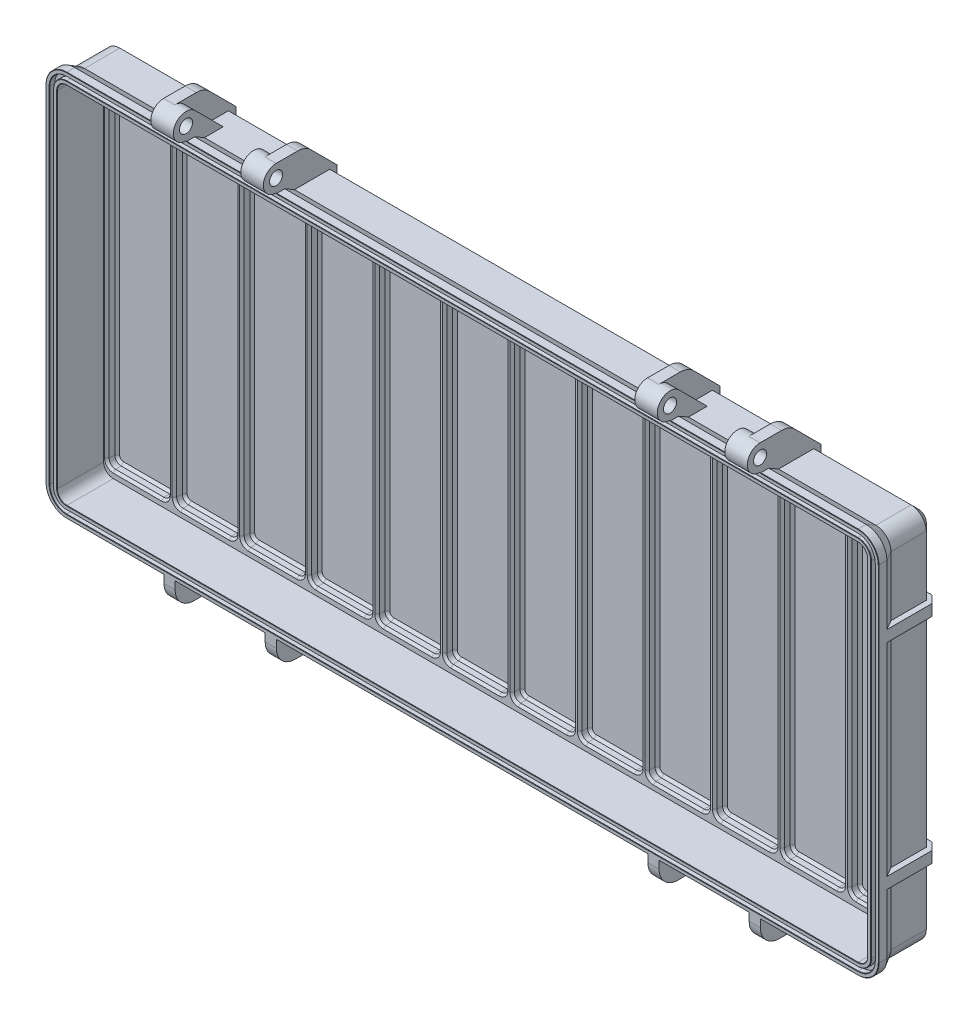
from build123d import *

# Parameters (mm, degrees)
BOSS_EXTRUDE1_DEPTH     = 1
BOSS_EXTRUDE1_DRAFT     = -45
BOSS_EXTRUDE2_DEPTH     = 13
BOSS_EXTRUDE3_DEPTH     = 5
BOSS_EXTRUDE3_DRAFT     = -30
BOSS_EXTRUDE4_DEPTH     = 2.2
SKETCH18_W              = 309.428038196
SKETCH18_H              = 147.831757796
CUT_EXTRUDE7_DEPTH      = 5
CUT_EXTRUDE7_DRAFT      = -45
CUT_EXTRUDE1_DEPTH      = 12.45
CUT_EXTRUDE2_DEPTH      = 0.6
CUT_EXTRUDE2_DRAFT      = -45
CUT_EXTRUDE3_DEPTH      = 1.5
CUT_EXTRUDE4_DEPTH      = 0.65
CUT_EXTRUDE4_DRAFT      = -45
LPATTERN1_COUNT         = 12
LPATTERN1_PITCH         = 18
LPATTERN1_COPY_1_DEPTH  = 0.6
LPATTERN1_COPY_1_DRAFT  = -45
LPATTERN1_COPY_2_DEPTH  = 0.6
LPATTERN1_COPY_2_DRAFT  = -45
LPATTERN1_COPY_3_DEPTH  = 0.6
LPATTERN1_COPY_3_DRAFT  = -45
LPATTERN1_COPY_4_DEPTH  = 0.6
LPATTERN1_COPY_4_DRAFT  = -45
LPATTERN1_COPY_5_DEPTH  = 0.6
LPATTERN1_COPY_5_DRAFT  = -45
LPATTERN1_COPY_6_DEPTH  = 0.6
LPATTERN1_COPY_6_DRAFT  = -45
LPATTERN1_COPY_7_DEPTH  = 0.6
LPATTERN1_COPY_7_DRAFT  = -45
LPATTERN1_COPY_8_DEPTH  = 0.6
LPATTERN1_COPY_8_DRAFT  = -45
LPATTERN1_COPY_9_DEPTH  = 0.6
LPATTERN1_COPY_9_DRAFT  = -45
LPATTERN1_COPY_10_DEPTH = 0.6
LPATTERN1_COPY_10_DRAFT = -45
LPATTERN1_COPY_11_DEPTH = 0.6
LPATTERN1_COPY_11_DRAFT = -45
LPATTERN1_COPY_12_DEPTH = 0.65
LPATTERN1_COPY_12_DRAFT = -45
LPATTERN1_COPY_13_DEPTH = 0.65
LPATTERN1_COPY_13_DRAFT = -45
LPATTERN1_COPY_14_DEPTH = 0.65
LPATTERN1_COPY_14_DRAFT = -45
LPATTERN1_COPY_15_DEPTH = 0.65
LPATTERN1_COPY_15_DRAFT = -45
LPATTERN1_COPY_16_DEPTH = 0.65
LPATTERN1_COPY_16_DRAFT = -45
LPATTERN1_COPY_17_DEPTH = 0.65
LPATTERN1_COPY_17_DRAFT = -45
LPATTERN1_COPY_18_DEPTH = 0.65
LPATTERN1_COPY_18_DRAFT = -45
LPATTERN1_COPY_19_DEPTH = 0.65
LPATTERN1_COPY_19_DRAFT = -45
LPATTERN1_COPY_20_DEPTH = 0.65
LPATTERN1_COPY_20_DRAFT = -45
LPATTERN1_COPY_21_DEPTH = 0.65
LPATTERN1_COPY_21_DRAFT = -45
LPATTERN1_COPY_22_DEPTH = 0.65
LPATTERN1_COPY_22_DRAFT = -45
CUT_EXTRUDE5_DEPTH      = 1.4
BOSS_EXTRUDE5_DEPTH     = 3
MIRROR2_COPY_1_DEPTH    = 3
CHAMFER1_SIZE           = 0.1
CHAMFER2_SIZE           = 0.1
SKETCH12_R              = 1.75
BOSS_EXTRUDE6_DEPTH     = 3
SKETCH13_R              = 1.75
BOSS_EXTRUDE7_DEPTH     = 3
MIRROR4_COPY_1_SKETCH_R = 1.75
MIRROR4_COPY_1_DEPTH    = 3
MIRROR4_COPY_2_SKETCH_R = 1.75
MIRROR4_COPY_2_DEPTH    = 3
SKETCH14_R              = 1.75
BOSS_EXTRUDE8_DEPTH     = 3
LPATTERN2_COUNT         = 2
LPATTERN2_PITCH         = 27
MIRROR5_COPY_1_SKETCH_R = 1.75
MIRROR5_COPY_1_DEPTH    = 3


with BuildPart() as part:
    # Sketch1 → Boss-Extrude1 (with draft: the straight prism first)
    with BuildSketch(Plane.XY):
        with BuildLine():
            ThreePointArc((-105.45, 50), (-108.313782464, 48.813782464), (-109.5, 45.95))
            Line((-109.5, 45.95), (-109.5, -45.95))
            ThreePointArc((-109.5, -45.95), (-108.313782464, -48.813782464), (-105.45, -50))
            Line((-105.45, -50), (105.45, -50))
            ThreePointArc((105.45, -50), (108.313782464, -48.813782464), (109.5, -45.95))
            Line((109.5, -45.95), (109.5, 45.95))
            ThreePointArc((109.5, 45.95), (108.313782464, 48.813782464), (105.45, 50))
            Line((105.45, 50), (-105.45, 50))
        make_face()
    extrude(amount=-BOSS_EXTRUDE1_DEPTH)
    # Boss-Extrude1: the draft: its side faces are tilted about the plane it starts from
    boss_extrude1_sides = [part.faces().sort_by_distance(p)[0] for p in [
        (-108.313782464, 48.813782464, -0.5),
        (-109.5, 0, -0.5),
        (-108.313782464, -48.813782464, -0.5),
        (0, -50, -0.5),
        (108.313782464, -48.813782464, -0.5),
        (109.5, 0, -0.5),
        (108.313782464, 48.813782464, -0.5),
        (0, 50, -0.5),
    ]]
    draft(boss_extrude1_sides, Plane.XY, BOSS_EXTRUDE1_DRAFT)

    # Sketch2 → Boss-Extrude2 (add)
    with BuildSketch(Plane.XY):
        with BuildLine():
            Line((-105.45, -50), (105.45, -50))
            ThreePointArc((105.45, -50), (108.313782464, -48.813782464), (109.5, -45.95))
            Line((109.5, -45.95), (109.5, 45.95))
            ThreePointArc((109.5, 45.95), (108.313782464, 48.813782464), (105.45, 50))
            Line((105.45, 50), (-105.45, 50))
            ThreePointArc((-105.45, 50), (-108.313782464, 48.813782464), (-109.5, 45.95))
            Line((-109.5, 45.95), (-109.5, -45.95))
            ThreePointArc((-109.5, -45.95), (-108.313782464, -48.813782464), (-105.45, -50))
        make_face()
    extrude(amount=BOSS_EXTRUDE2_DEPTH)


with BuildPart() as boss_extrude3_tool:
    # Sketch3 → Boss-Extrude3 (with draft: the straight prism first)
    with BuildSketch(Plane.XY.offset(13)):
        with BuildLine():
            Line((-105.45, -51.5), (105.45, -51.5))
            ThreePointArc((105.45, -51.5), (109.374442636, -49.874442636), (111, -45.95))
            Line((111, -45.95), (111, 45.95))
            ThreePointArc((111, 45.95), (109.374442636, 49.874442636), (105.45, 51.5))
            Line((105.45, 51.5), (-105.45, 51.5))
            ThreePointArc((-105.45, 51.5), (-109.374442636, 49.874442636), (-111, 45.95))
            Line((-111, 45.95), (-111, -45.95))
            ThreePointArc((-111, -45.95), (-109.374442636, -49.874442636), (-105.45, -51.5))
        make_face()
    extrude(amount=-BOSS_EXTRUDE3_DEPTH)
    # Boss-Extrude3: the draft: its side faces are tilted about the plane it starts from
    boss_extrude3_sides = [boss_extrude3_tool.faces().sort_by_distance(p)[0] for p in [
        (-111, 0, 10.5),
        (-109.374442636, -49.874442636, 10.5),
        (0, -51.5, 10.5),
        (109.374442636, -49.874442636, 10.5),
        (111, 0, 10.5),
        (109.374442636, 49.874442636, 10.5),
        (0, 51.5, 10.5),
        (-109.374442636, 49.874442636, 10.5),
    ]]
    draft(boss_extrude3_sides, Plane.XY.offset(13), BOSS_EXTRUDE3_DRAFT)


with BuildPart() as part_1:
    add(part.part)

    # Boss-Extrude3: add boss_extrude3_tool
    add(boss_extrude3_tool.part)

    # Sketch4 → Boss-Extrude4 (add)
    with BuildSketch(Plane.XY.offset(13)):
        with BuildLine():
            Line((-105.45, -51.5), (105.45, -51.5))
            ThreePointArc((105.45, -51.5), (109.374442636, -49.874442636), (111, -45.95))
            Line((111, -45.95), (111, 45.95))
            ThreePointArc((111, 45.95), (109.374442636, 49.874442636), (105.45, 51.5))
            Line((105.45, 51.5), (-105.45, 51.5))
            ThreePointArc((-105.45, 51.5), (-109.374442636, 49.874442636), (-111, 45.95))
            Line((-111, 45.95), (-111, -45.95))
            ThreePointArc((-111, -45.95), (-109.374442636, -49.874442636), (-105.45, -51.5))
        make_face()
    extrude(amount=BOSS_EXTRUDE4_DEPTH)


with BuildPart() as cut_extrude7_tool:
    # Sketch18 → Cut-Extrude7 (with draft: the straight prism first)
    with BuildSketch(Plane(origin=(0, 0, -1), x_dir=(-1, 0, 0), z_dir=(0, 0, -1))):
        Rectangle(SKETCH18_W, SKETCH18_H)
        with BuildLine():
            Line((107.5, -45.95), (107.5, 45.95))
            ThreePointArc((107.5, 45.95), (106.899568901, 47.399568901), (105.45, 48))
            Line((105.45, 48), (-105.45, 48))
            ThreePointArc((-105.45, 48), (-106.899568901, 47.399568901), (-107.5, 45.95))
            Line((-107.5, 45.95), (-107.5, -45.95))
            ThreePointArc((-107.5, -45.95), (-106.899568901, -47.399568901), (-105.45, -48))
            Line((-105.45, -48), (105.45, -48))
            ThreePointArc((105.45, -48), (106.899568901, -47.399568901), (107.5, -45.95))
        make_face(mode=Mode.SUBTRACT)
    extrude(amount=-CUT_EXTRUDE7_DEPTH)
    # Cut-Extrude7: the draft: its side faces are tilted about the plane it starts from
    cut_extrude7_sides = [cut_extrude7_tool.faces().sort_by_distance(p)[0] for p in [
        (154.714019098, 0, 1.5),
        (0, -73.915878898, 1.5),
        (-154.714019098, 0, 1.5),
        (0, 73.915878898, 1.5),
        (0, -48, 1.5),
        (106.899568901, -47.399568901, 1.5),
        (107.5, 0, 1.5),
        (106.899568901, 47.399568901, 1.5),
        (0, 48, 1.5),
        (-106.899568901, 47.399568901, 1.5),
        (-107.5, 0, 1.5),
        (-106.899568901, -47.399568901, 1.5),
    ]]
    draft(cut_extrude7_sides, Plane(origin=(0, 0, -1), x_dir=(-1, 0, 0), z_dir=(0, 0, -1)), CUT_EXTRUDE7_DRAFT)


with BuildPart() as part_2:
    add(part_1.part)

    # Cut-Extrude7: cut by cut_extrude7_tool
    add(cut_extrude7_tool.part, mode=Mode.SUBTRACT)

    # Sketch5 → Cut-Extrude1 (cut)
    with BuildSketch(Plane.XY.offset(15.2)):
        with BuildLine():
            Line((-105.45, -48.5), (105.45, -48.5))
            ThreePointArc((105.45, -48.5), (107.253122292, -47.753122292), (108, -45.95))
            Line((108, -45.95), (108, 45.95))
            ThreePointArc((108, 45.95), (107.253122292, 47.753122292), (105.45, 48.5))
            Line((105.45, 48.5), (-105.45, 48.5))
            ThreePointArc((-105.45, 48.5), (-107.253122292, 47.753122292), (-108, 45.95))
            Line((-108, 45.95), (-108, -45.95))
            ThreePointArc((-108, -45.95), (-107.253122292, -47.753122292), (-105.45, -48.5))
        make_face()
    extrude(amount=-CUT_EXTRUDE1_DEPTH, mode=Mode.SUBTRACT)


with BuildPart() as cut_extrude2_tool:
    # Sketch6 → Cut-Extrude2 (with draft: the straight prism first)
    with BuildSketch(Plane.XY.offset(2.75)):
        with BuildLine():
            ThreePointArc((-105.45, 48.25), (-107.076345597, 47.576345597), (-107.75, 45.95))
            Line((-107.75, 45.95), (-107.75, -44.95))
            ThreePointArc((-107.75, -44.95), (-107.076345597, -46.576345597), (-105.45, -47.25))
            Line((-105.45, -47.25), (-92.55, -47.25))
            ThreePointArc((-92.55, -47.25), (-90.923654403, -46.576345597), (-90.25, -44.95))
            Line((-90.25, -44.95), (-90.25, 45.95))
            ThreePointArc((-90.25, 45.95), (-90.923654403, 47.576345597), (-92.55, 48.25))
            Line((-92.55, 48.25), (-105.45, 48.25))
        make_face()
    extrude(amount=-CUT_EXTRUDE2_DEPTH)
    # Cut-Extrude2: the draft: its side faces are tilted about the plane it starts from
    cut_extrude2_sides = [cut_extrude2_tool.faces().sort_by_distance(p)[0] for p in [
        (-99, 48.25, 2.45),
        (-107.076345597, 47.576345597, 2.45),
        (-107.75, 0.5, 2.45),
        (-107.076345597, -46.576345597, 2.45),
        (-99, -47.25, 2.45),
        (-90.923654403, -46.576345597, 2.45),
        (-90.25, 0.5, 2.45),
        (-90.923654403, 47.576345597, 2.45),
    ]]
    draft(cut_extrude2_sides, Plane.XY.offset(2.75), CUT_EXTRUDE2_DRAFT)


with BuildPart() as part_3:
    add(part_2.part)

    # Cut-Extrude2: cut by cut_extrude2_tool
    add(cut_extrude2_tool.part, mode=Mode.SUBTRACT)

    # Sketch7 → Cut-Extrude3 (cut)
    with BuildSketch(Plane.XY.offset(2.15)):
        with BuildLine():
            Line((-90.85, -44.95), (-90.85, 45.95))
            ThreePointArc((-90.85, 45.95), (-91.347918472, 47.152081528), (-92.55, 47.65))
            Line((-92.55, 47.65), (-105.45, 47.65))
            ThreePointArc((-105.45, 47.65), (-106.652081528, 47.152081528), (-107.15, 45.95))
            Line((-107.15, 45.95), (-107.15, -44.95))
            ThreePointArc((-107.15, -44.95), (-106.652081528, -46.152081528), (-105.45, -46.65))
            Line((-105.45, -46.65), (-92.55, -46.65))
            ThreePointArc((-92.55, -46.65), (-91.347918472, -46.152081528), (-90.85, -44.95))
        make_face()
    cut_extrude3 = extrude(amount=-CUT_EXTRUDE3_DEPTH, mode=Mode.SUBTRACT)


with BuildPart() as cut_extrude4_tool:
    # Sketch8 → Cut-Extrude4 (with draft: the straight prism first)
    with BuildSketch(Plane.XY.offset(0.65)):
        with BuildLine():
            Line((-90.85, -44.95), (-90.85, 45.95))
            ThreePointArc((-90.85, 45.95), (-91.347918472, 47.152081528), (-92.55, 47.65))
            Line((-92.55, 47.65), (-105.45, 47.65))
            ThreePointArc((-105.45, 47.65), (-106.652081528, 47.152081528), (-107.15, 45.95))
            Line((-107.15, 45.95), (-107.15, -44.95))
            ThreePointArc((-107.15, -44.95), (-106.652081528, -46.152081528), (-105.45, -46.65))
            Line((-105.45, -46.65), (-92.55, -46.65))
            ThreePointArc((-92.55, -46.65), (-91.347918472, -46.152081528), (-90.85, -44.95))
        make_face()
    extrude(amount=-CUT_EXTRUDE4_DEPTH)
    # Cut-Extrude4: the draft: its side faces are tilted about the plane it starts from
    cut_extrude4_sides = [cut_extrude4_tool.faces().sort_by_distance(p)[0] for p in [
        (-99, -46.65, 0.325),
        (-91.347918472, -46.152081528, 0.325),
        (-90.85, 0.5, 0.325),
        (-91.347918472, 47.152081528, 0.325),
        (-99, 47.65, 0.325),
        (-106.652081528, 47.152081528, 0.325),
        (-107.15, 0.5, 0.325),
        (-106.652081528, -46.152081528, 0.325),
    ]]
    draft(cut_extrude4_sides, Plane.XY.offset(0.65), CUT_EXTRUDE4_DRAFT)


with BuildPart() as part_4:
    add(part_3.part)

    # Cut-Extrude4: cut by cut_extrude4_tool
    add(cut_extrude4_tool.part, mode=Mode.SUBTRACT)

    # LPattern1: Cut-Extrude3 ×12
    with Locations(*[(i * LPATTERN1_PITCH, 0, 0) for i in range(1, LPATTERN1_COUNT)]):
        add(cut_extrude3, mode=Mode.SUBTRACT)


with BuildPart() as lpattern1_copy_1_tool:
    # LPattern1 copy 1 sketch → LPattern1 copy 1 (with draft: the straight prism first)
    with BuildSketch(Plane(origin=(18, 0, 2.75), x_dir=(1, 0, 0), z_dir=(0, 0, 1))):
        with BuildLine():
            ThreePointArc((-105.45, 48.25), (-107.076345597, 47.576345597), (-107.75, 45.95))
            Line((-107.75, 45.95), (-107.75, -44.95))
            ThreePointArc((-107.75, -44.95), (-107.076345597, -46.576345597), (-105.45, -47.25))
            Line((-105.45, -47.25), (-92.55, -47.25))
            ThreePointArc((-92.55, -47.25), (-90.923654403, -46.576345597), (-90.25, -44.95))
            Line((-90.25, -44.95), (-90.25, 45.95))
            ThreePointArc((-90.25, 45.95), (-90.923654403, 47.576345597), (-92.55, 48.25))
            Line((-92.55, 48.25), (-105.45, 48.25))
        make_face()
    extrude(amount=-LPATTERN1_COPY_1_DEPTH)
    # LPattern1 copy 1: the draft: its side faces are tilted about the plane it starts from
    lpattern1_copy_1_sides = [lpattern1_copy_1_tool.faces().sort_by_distance(p)[0] for p in [
        (-81, 48.25, 2.45),
        (-89.076345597, 47.576345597, 2.45),
        (-89.75, 0.5, 2.45),
        (-89.076345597, -46.576345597, 2.45),
        (-81, -47.25, 2.45),
        (-72.923654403, -46.576345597, 2.45),
        (-72.25, 0.5, 2.45),
        (-72.923654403, 47.576345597, 2.45),
    ]]
    draft(lpattern1_copy_1_sides, Plane(origin=(18, 0, 2.75), x_dir=(1, 0, 0), z_dir=(0, 0, 1)), LPATTERN1_COPY_1_DRAFT)


with BuildPart() as part_5:
    add(part_4.part)

    # LPattern1 copy 1: cut by lpattern1_copy_1_tool
    add(lpattern1_copy_1_tool.part, mode=Mode.SUBTRACT)


with BuildPart() as lpattern1_copy_2_tool:
    # LPattern1 copy 2 sketch → LPattern1 copy 2 (with draft: the straight prism first)
    with BuildSketch(Plane(origin=(36, 0, 2.75), x_dir=(1, 0, 0), z_dir=(0, 0, 1))):
        with BuildLine():
            ThreePointArc((-105.45, 48.25), (-107.076345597, 47.576345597), (-107.75, 45.95))
            Line((-107.75, 45.95), (-107.75, -44.95))
            ThreePointArc((-107.75, -44.95), (-107.076345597, -46.576345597), (-105.45, -47.25))
            Line((-105.45, -47.25), (-92.55, -47.25))
            ThreePointArc((-92.55, -47.25), (-90.923654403, -46.576345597), (-90.25, -44.95))
            Line((-90.25, -44.95), (-90.25, 45.95))
            ThreePointArc((-90.25, 45.95), (-90.923654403, 47.576345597), (-92.55, 48.25))
            Line((-92.55, 48.25), (-105.45, 48.25))
        make_face()
    extrude(amount=-LPATTERN1_COPY_2_DEPTH)
    # LPattern1 copy 2: the draft: its side faces are tilted about the plane it starts from
    lpattern1_copy_2_sides = [lpattern1_copy_2_tool.faces().sort_by_distance(p)[0] for p in [
        (-63, 48.25, 2.45),
        (-71.076345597, 47.576345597, 2.45),
        (-71.75, 0.5, 2.45),
        (-71.076345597, -46.576345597, 2.45),
        (-63, -47.25, 2.45),
        (-54.923654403, -46.576345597, 2.45),
        (-54.25, 0.5, 2.45),
        (-54.923654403, 47.576345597, 2.45),
    ]]
    draft(lpattern1_copy_2_sides, Plane(origin=(36, 0, 2.75), x_dir=(1, 0, 0), z_dir=(0, 0, 1)), LPATTERN1_COPY_2_DRAFT)


with BuildPart() as part_6:
    add(part_5.part)

    # LPattern1 copy 2: cut by lpattern1_copy_2_tool
    add(lpattern1_copy_2_tool.part, mode=Mode.SUBTRACT)


with BuildPart() as lpattern1_copy_3_tool:
    # LPattern1 copy 3 sketch → LPattern1 copy 3 (with draft: the straight prism first)
    with BuildSketch(Plane(origin=(54, 0, 2.75), x_dir=(1, 0, 0), z_dir=(0, 0, 1))):
        with BuildLine():
            ThreePointArc((-105.45, 48.25), (-107.076345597, 47.576345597), (-107.75, 45.95))
            Line((-107.75, 45.95), (-107.75, -44.95))
            ThreePointArc((-107.75, -44.95), (-107.076345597, -46.576345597), (-105.45, -47.25))
            Line((-105.45, -47.25), (-92.55, -47.25))
            ThreePointArc((-92.55, -47.25), (-90.923654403, -46.576345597), (-90.25, -44.95))
            Line((-90.25, -44.95), (-90.25, 45.95))
            ThreePointArc((-90.25, 45.95), (-90.923654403, 47.576345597), (-92.55, 48.25))
            Line((-92.55, 48.25), (-105.45, 48.25))
        make_face()
    extrude(amount=-LPATTERN1_COPY_3_DEPTH)
    # LPattern1 copy 3: the draft: its side faces are tilted about the plane it starts from
    lpattern1_copy_3_sides = [lpattern1_copy_3_tool.faces().sort_by_distance(p)[0] for p in [
        (-45, 48.25, 2.45),
        (-53.076345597, 47.576345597, 2.45),
        (-53.75, 0.5, 2.45),
        (-53.076345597, -46.576345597, 2.45),
        (-45, -47.25, 2.45),
        (-36.923654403, -46.576345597, 2.45),
        (-36.25, 0.5, 2.45),
        (-36.923654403, 47.576345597, 2.45),
    ]]
    draft(lpattern1_copy_3_sides, Plane(origin=(54, 0, 2.75), x_dir=(1, 0, 0), z_dir=(0, 0, 1)), LPATTERN1_COPY_3_DRAFT)


with BuildPart() as part_7:
    add(part_6.part)

    # LPattern1 copy 3: cut by lpattern1_copy_3_tool
    add(lpattern1_copy_3_tool.part, mode=Mode.SUBTRACT)


with BuildPart() as lpattern1_copy_4_tool:
    # LPattern1 copy 4 sketch → LPattern1 copy 4 (with draft: the straight prism first)
    with BuildSketch(Plane(origin=(72, 0, 2.75), x_dir=(1, 0, 0), z_dir=(0, 0, 1))):
        with BuildLine():
            ThreePointArc((-105.45, 48.25), (-107.076345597, 47.576345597), (-107.75, 45.95))
            Line((-107.75, 45.95), (-107.75, -44.95))
            ThreePointArc((-107.75, -44.95), (-107.076345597, -46.576345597), (-105.45, -47.25))
            Line((-105.45, -47.25), (-92.55, -47.25))
            ThreePointArc((-92.55, -47.25), (-90.923654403, -46.576345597), (-90.25, -44.95))
            Line((-90.25, -44.95), (-90.25, 45.95))
            ThreePointArc((-90.25, 45.95), (-90.923654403, 47.576345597), (-92.55, 48.25))
            Line((-92.55, 48.25), (-105.45, 48.25))
        make_face()
    extrude(amount=-LPATTERN1_COPY_4_DEPTH)
    # LPattern1 copy 4: the draft: its side faces are tilted about the plane it starts from
    lpattern1_copy_4_sides = [lpattern1_copy_4_tool.faces().sort_by_distance(p)[0] for p in [
        (-27, 48.25, 2.45),
        (-35.076345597, 47.576345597, 2.45),
        (-35.75, 0.5, 2.45),
        (-35.076345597, -46.576345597, 2.45),
        (-27, -47.25, 2.45),
        (-18.923654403, -46.576345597, 2.45),
        (-18.25, 0.5, 2.45),
        (-18.923654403, 47.576345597, 2.45),
    ]]
    draft(lpattern1_copy_4_sides, Plane(origin=(72, 0, 2.75), x_dir=(1, 0, 0), z_dir=(0, 0, 1)), LPATTERN1_COPY_4_DRAFT)


with BuildPart() as part_8:
    add(part_7.part)

    # LPattern1 copy 4: cut by lpattern1_copy_4_tool
    add(lpattern1_copy_4_tool.part, mode=Mode.SUBTRACT)


with BuildPart() as lpattern1_copy_5_tool:
    # LPattern1 copy 5 sketch → LPattern1 copy 5 (with draft: the straight prism first)
    with BuildSketch(Plane(origin=(90, 0, 2.75), x_dir=(1, 0, 0), z_dir=(0, 0, 1))):
        with BuildLine():
            ThreePointArc((-105.45, 48.25), (-107.076345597, 47.576345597), (-107.75, 45.95))
            Line((-107.75, 45.95), (-107.75, -44.95))
            ThreePointArc((-107.75, -44.95), (-107.076345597, -46.576345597), (-105.45, -47.25))
            Line((-105.45, -47.25), (-92.55, -47.25))
            ThreePointArc((-92.55, -47.25), (-90.923654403, -46.576345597), (-90.25, -44.95))
            Line((-90.25, -44.95), (-90.25, 45.95))
            ThreePointArc((-90.25, 45.95), (-90.923654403, 47.576345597), (-92.55, 48.25))
            Line((-92.55, 48.25), (-105.45, 48.25))
        make_face()
    extrude(amount=-LPATTERN1_COPY_5_DEPTH)
    # LPattern1 copy 5: the draft: its side faces are tilted about the plane it starts from
    lpattern1_copy_5_sides = [lpattern1_copy_5_tool.faces().sort_by_distance(p)[0] for p in [
        (-9, 48.25, 2.45),
        (-17.076345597, 47.576345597, 2.45),
        (-17.75, 0.5, 2.45),
        (-17.076345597, -46.576345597, 2.45),
        (-9, -47.25, 2.45),
        (-0.923654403, -46.576345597, 2.45),
        (-0.25, 0.5, 2.45),
        (-0.923654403, 47.576345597, 2.45),
    ]]
    draft(lpattern1_copy_5_sides, Plane(origin=(90, 0, 2.75), x_dir=(1, 0, 0), z_dir=(0, 0, 1)), LPATTERN1_COPY_5_DRAFT)


with BuildPart() as part_9:
    add(part_8.part)

    # LPattern1 copy 5: cut by lpattern1_copy_5_tool
    add(lpattern1_copy_5_tool.part, mode=Mode.SUBTRACT)


with BuildPart() as lpattern1_copy_6_tool:
    # LPattern1 copy 6 sketch → LPattern1 copy 6 (with draft: the straight prism first)
    with BuildSketch(Plane(origin=(108, 0, 2.75), x_dir=(1, 0, 0), z_dir=(0, 0, 1))):
        with BuildLine():
            ThreePointArc((-105.45, 48.25), (-107.076345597, 47.576345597), (-107.75, 45.95))
            Line((-107.75, 45.95), (-107.75, -44.95))
            ThreePointArc((-107.75, -44.95), (-107.076345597, -46.576345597), (-105.45, -47.25))
            Line((-105.45, -47.25), (-92.55, -47.25))
            ThreePointArc((-92.55, -47.25), (-90.923654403, -46.576345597), (-90.25, -44.95))
            Line((-90.25, -44.95), (-90.25, 45.95))
            ThreePointArc((-90.25, 45.95), (-90.923654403, 47.576345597), (-92.55, 48.25))
            Line((-92.55, 48.25), (-105.45, 48.25))
        make_face()
    extrude(amount=-LPATTERN1_COPY_6_DEPTH)
    # LPattern1 copy 6: the draft: its side faces are tilted about the plane it starts from
    lpattern1_copy_6_sides = [lpattern1_copy_6_tool.faces().sort_by_distance(p)[0] for p in [
        (9, 48.25, 2.45),
        (0.923654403, 47.576345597, 2.45),
        (0.25, 0.5, 2.45),
        (0.923654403, -46.576345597, 2.45),
        (9, -47.25, 2.45),
        (17.076345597, -46.576345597, 2.45),
        (17.75, 0.5, 2.45),
        (17.076345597, 47.576345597, 2.45),
    ]]
    draft(lpattern1_copy_6_sides, Plane(origin=(108, 0, 2.75), x_dir=(1, 0, 0), z_dir=(0, 0, 1)), LPATTERN1_COPY_6_DRAFT)


with BuildPart() as part_10:
    add(part_9.part)

    # LPattern1 copy 6: cut by lpattern1_copy_6_tool
    add(lpattern1_copy_6_tool.part, mode=Mode.SUBTRACT)


with BuildPart() as lpattern1_copy_7_tool:
    # LPattern1 copy 7 sketch → LPattern1 copy 7 (with draft: the straight prism first)
    with BuildSketch(Plane(origin=(126, 0, 2.75), x_dir=(1, 0, 0), z_dir=(0, 0, 1))):
        with BuildLine():
            ThreePointArc((-105.45, 48.25), (-107.076345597, 47.576345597), (-107.75, 45.95))
            Line((-107.75, 45.95), (-107.75, -44.95))
            ThreePointArc((-107.75, -44.95), (-107.076345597, -46.576345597), (-105.45, -47.25))
            Line((-105.45, -47.25), (-92.55, -47.25))
            ThreePointArc((-92.55, -47.25), (-90.923654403, -46.576345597), (-90.25, -44.95))
            Line((-90.25, -44.95), (-90.25, 45.95))
            ThreePointArc((-90.25, 45.95), (-90.923654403, 47.576345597), (-92.55, 48.25))
            Line((-92.55, 48.25), (-105.45, 48.25))
        make_face()
    extrude(amount=-LPATTERN1_COPY_7_DEPTH)
    # LPattern1 copy 7: the draft: its side faces are tilted about the plane it starts from
    lpattern1_copy_7_sides = [lpattern1_copy_7_tool.faces().sort_by_distance(p)[0] for p in [
        (27, 48.25, 2.45),
        (18.923654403, 47.576345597, 2.45),
        (18.25, 0.5, 2.45),
        (18.923654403, -46.576345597, 2.45),
        (27, -47.25, 2.45),
        (35.076345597, -46.576345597, 2.45),
        (35.75, 0.5, 2.45),
        (35.076345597, 47.576345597, 2.45),
    ]]
    draft(lpattern1_copy_7_sides, Plane(origin=(126, 0, 2.75), x_dir=(1, 0, 0), z_dir=(0, 0, 1)), LPATTERN1_COPY_7_DRAFT)


with BuildPart() as part_11:
    add(part_10.part)

    # LPattern1 copy 7: cut by lpattern1_copy_7_tool
    add(lpattern1_copy_7_tool.part, mode=Mode.SUBTRACT)


with BuildPart() as lpattern1_copy_8_tool:
    # LPattern1 copy 8 sketch → LPattern1 copy 8 (with draft: the straight prism first)
    with BuildSketch(Plane(origin=(144, 0, 2.75), x_dir=(1, 0, 0), z_dir=(0, 0, 1))):
        with BuildLine():
            ThreePointArc((-105.45, 48.25), (-107.076345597, 47.576345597), (-107.75, 45.95))
            Line((-107.75, 45.95), (-107.75, -44.95))
            ThreePointArc((-107.75, -44.95), (-107.076345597, -46.576345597), (-105.45, -47.25))
            Line((-105.45, -47.25), (-92.55, -47.25))
            ThreePointArc((-92.55, -47.25), (-90.923654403, -46.576345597), (-90.25, -44.95))
            Line((-90.25, -44.95), (-90.25, 45.95))
            ThreePointArc((-90.25, 45.95), (-90.923654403, 47.576345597), (-92.55, 48.25))
            Line((-92.55, 48.25), (-105.45, 48.25))
        make_face()
    extrude(amount=-LPATTERN1_COPY_8_DEPTH)
    # LPattern1 copy 8: the draft: its side faces are tilted about the plane it starts from
    lpattern1_copy_8_sides = [lpattern1_copy_8_tool.faces().sort_by_distance(p)[0] for p in [
        (45, 48.25, 2.45),
        (36.923654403, 47.576345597, 2.45),
        (36.25, 0.5, 2.45),
        (36.923654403, -46.576345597, 2.45),
        (45, -47.25, 2.45),
        (53.076345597, -46.576345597, 2.45),
        (53.75, 0.5, 2.45),
        (53.076345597, 47.576345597, 2.45),
    ]]
    draft(lpattern1_copy_8_sides, Plane(origin=(144, 0, 2.75), x_dir=(1, 0, 0), z_dir=(0, 0, 1)), LPATTERN1_COPY_8_DRAFT)


with BuildPart() as part_12:
    add(part_11.part)

    # LPattern1 copy 8: cut by lpattern1_copy_8_tool
    add(lpattern1_copy_8_tool.part, mode=Mode.SUBTRACT)


with BuildPart() as lpattern1_copy_9_tool:
    # LPattern1 copy 9 sketch → LPattern1 copy 9 (with draft: the straight prism first)
    with BuildSketch(Plane(origin=(162, 0, 2.75), x_dir=(1, 0, 0), z_dir=(0, 0, 1))):
        with BuildLine():
            ThreePointArc((-105.45, 48.25), (-107.076345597, 47.576345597), (-107.75, 45.95))
            Line((-107.75, 45.95), (-107.75, -44.95))
            ThreePointArc((-107.75, -44.95), (-107.076345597, -46.576345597), (-105.45, -47.25))
            Line((-105.45, -47.25), (-92.55, -47.25))
            ThreePointArc((-92.55, -47.25), (-90.923654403, -46.576345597), (-90.25, -44.95))
            Line((-90.25, -44.95), (-90.25, 45.95))
            ThreePointArc((-90.25, 45.95), (-90.923654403, 47.576345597), (-92.55, 48.25))
            Line((-92.55, 48.25), (-105.45, 48.25))
        make_face()
    extrude(amount=-LPATTERN1_COPY_9_DEPTH)
    # LPattern1 copy 9: the draft: its side faces are tilted about the plane it starts from
    lpattern1_copy_9_sides = [lpattern1_copy_9_tool.faces().sort_by_distance(p)[0] for p in [
        (63, 48.25, 2.45),
        (54.923654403, 47.576345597, 2.45),
        (54.25, 0.5, 2.45),
        (54.923654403, -46.576345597, 2.45),
        (63, -47.25, 2.45),
        (71.076345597, -46.576345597, 2.45),
        (71.75, 0.5, 2.45),
        (71.076345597, 47.576345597, 2.45),
    ]]
    draft(lpattern1_copy_9_sides, Plane(origin=(162, 0, 2.75), x_dir=(1, 0, 0), z_dir=(0, 0, 1)), LPATTERN1_COPY_9_DRAFT)


with BuildPart() as part_13:
    add(part_12.part)

    # LPattern1 copy 9: cut by lpattern1_copy_9_tool
    add(lpattern1_copy_9_tool.part, mode=Mode.SUBTRACT)


with BuildPart() as lpattern1_copy_10_tool:
    # LPattern1 copy 10 sketch → LPattern1 copy 10 (with draft: the straight prism first)
    with BuildSketch(Plane(origin=(180, 0, 2.75), x_dir=(1, 0, 0), z_dir=(0, 0, 1))):
        with BuildLine():
            ThreePointArc((-105.45, 48.25), (-107.076345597, 47.576345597), (-107.75, 45.95))
            Line((-107.75, 45.95), (-107.75, -44.95))
            ThreePointArc((-107.75, -44.95), (-107.076345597, -46.576345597), (-105.45, -47.25))
            Line((-105.45, -47.25), (-92.55, -47.25))
            ThreePointArc((-92.55, -47.25), (-90.923654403, -46.576345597), (-90.25, -44.95))
            Line((-90.25, -44.95), (-90.25, 45.95))
            ThreePointArc((-90.25, 45.95), (-90.923654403, 47.576345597), (-92.55, 48.25))
            Line((-92.55, 48.25), (-105.45, 48.25))
        make_face()
    extrude(amount=-LPATTERN1_COPY_10_DEPTH)
    # LPattern1 copy 10: the draft: its side faces are tilted about the plane it starts from
    lpattern1_copy_10_sides = [lpattern1_copy_10_tool.faces().sort_by_distance(p)[0] for p in [
        (81, 48.25, 2.45),
        (72.923654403, 47.576345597, 2.45),
        (72.25, 0.5, 2.45),
        (72.923654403, -46.576345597, 2.45),
        (81, -47.25, 2.45),
        (89.076345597, -46.576345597, 2.45),
        (89.75, 0.5, 2.45),
        (89.076345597, 47.576345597, 2.45),
    ]]
    draft(lpattern1_copy_10_sides, Plane(origin=(180, 0, 2.75), x_dir=(1, 0, 0), z_dir=(0, 0, 1)), LPATTERN1_COPY_10_DRAFT)


with BuildPart() as part_14:
    add(part_13.part)

    # LPattern1 copy 10: cut by lpattern1_copy_10_tool
    add(lpattern1_copy_10_tool.part, mode=Mode.SUBTRACT)


with BuildPart() as lpattern1_copy_11_tool:
    # LPattern1 copy 11 sketch → LPattern1 copy 11 (with draft: the straight prism first)
    with BuildSketch(Plane(origin=(198, 0, 2.75), x_dir=(1, 0, 0), z_dir=(0, 0, 1))):
        with BuildLine():
            ThreePointArc((-105.45, 48.25), (-107.076345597, 47.576345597), (-107.75, 45.95))
            Line((-107.75, 45.95), (-107.75, -44.95))
            ThreePointArc((-107.75, -44.95), (-107.076345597, -46.576345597), (-105.45, -47.25))
            Line((-105.45, -47.25), (-92.55, -47.25))
            ThreePointArc((-92.55, -47.25), (-90.923654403, -46.576345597), (-90.25, -44.95))
            Line((-90.25, -44.95), (-90.25, 45.95))
            ThreePointArc((-90.25, 45.95), (-90.923654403, 47.576345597), (-92.55, 48.25))
            Line((-92.55, 48.25), (-105.45, 48.25))
        make_face()
    extrude(amount=-LPATTERN1_COPY_11_DEPTH)
    # LPattern1 copy 11: the draft: its side faces are tilted about the plane it starts from
    lpattern1_copy_11_sides = [lpattern1_copy_11_tool.faces().sort_by_distance(p)[0] for p in [
        (99, 48.25, 2.45),
        (90.923654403, 47.576345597, 2.45),
        (90.25, 0.5, 2.45),
        (90.923654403, -46.576345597, 2.45),
        (99, -47.25, 2.45),
        (107.076345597, -46.576345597, 2.45),
        (107.75, 0.5, 2.45),
        (107.076345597, 47.576345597, 2.45),
    ]]
    draft(lpattern1_copy_11_sides, Plane(origin=(198, 0, 2.75), x_dir=(1, 0, 0), z_dir=(0, 0, 1)), LPATTERN1_COPY_11_DRAFT)


with BuildPart() as part_15:
    add(part_14.part)

    # LPattern1 copy 11: cut by lpattern1_copy_11_tool
    add(lpattern1_copy_11_tool.part, mode=Mode.SUBTRACT)


with BuildPart() as lpattern1_copy_12_tool:
    # LPattern1 copy 12 sketch → LPattern1 copy 12 (with draft: the straight prism first)
    with BuildSketch(Plane(origin=(18, 0, 0.65), x_dir=(1, 0, 0), z_dir=(0, 0, 1))):
        with BuildLine():
            Line((-90.85, -44.95), (-90.85, 45.95))
            ThreePointArc((-90.85, 45.95), (-91.347918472, 47.152081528), (-92.55, 47.65))
            Line((-92.55, 47.65), (-105.45, 47.65))
            ThreePointArc((-105.45, 47.65), (-106.652081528, 47.152081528), (-107.15, 45.95))
            Line((-107.15, 45.95), (-107.15, -44.95))
            ThreePointArc((-107.15, -44.95), (-106.652081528, -46.152081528), (-105.45, -46.65))
            Line((-105.45, -46.65), (-92.55, -46.65))
            ThreePointArc((-92.55, -46.65), (-91.347918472, -46.152081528), (-90.85, -44.95))
        make_face()
    extrude(amount=-LPATTERN1_COPY_12_DEPTH)
    # LPattern1 copy 12: the draft: its side faces are tilted about the plane it starts from
    lpattern1_copy_12_sides = [lpattern1_copy_12_tool.faces().sort_by_distance(p)[0] for p in [
        (-81, -46.65, 0.325),
        (-73.347918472, -46.152081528, 0.325),
        (-72.85, 0.5, 0.325),
        (-73.347918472, 47.152081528, 0.325),
        (-81, 47.65, 0.325),
        (-88.652081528, 47.152081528, 0.325),
        (-89.15, 0.5, 0.325),
        (-88.652081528, -46.152081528, 0.325),
    ]]
    draft(lpattern1_copy_12_sides, Plane(origin=(18, 0, 0.65), x_dir=(1, 0, 0), z_dir=(0, 0, 1)), LPATTERN1_COPY_12_DRAFT)


with BuildPart() as part_16:
    add(part_15.part)

    # LPattern1 copy 12: cut by lpattern1_copy_12_tool
    add(lpattern1_copy_12_tool.part, mode=Mode.SUBTRACT)


with BuildPart() as lpattern1_copy_13_tool:
    # LPattern1 copy 13 sketch → LPattern1 copy 13 (with draft: the straight prism first)
    with BuildSketch(Plane(origin=(36, 0, 0.65), x_dir=(1, 0, 0), z_dir=(0, 0, 1))):
        with BuildLine():
            Line((-90.85, -44.95), (-90.85, 45.95))
            ThreePointArc((-90.85, 45.95), (-91.347918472, 47.152081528), (-92.55, 47.65))
            Line((-92.55, 47.65), (-105.45, 47.65))
            ThreePointArc((-105.45, 47.65), (-106.652081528, 47.152081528), (-107.15, 45.95))
            Line((-107.15, 45.95), (-107.15, -44.95))
            ThreePointArc((-107.15, -44.95), (-106.652081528, -46.152081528), (-105.45, -46.65))
            Line((-105.45, -46.65), (-92.55, -46.65))
            ThreePointArc((-92.55, -46.65), (-91.347918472, -46.152081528), (-90.85, -44.95))
        make_face()
    extrude(amount=-LPATTERN1_COPY_13_DEPTH)
    # LPattern1 copy 13: the draft: its side faces are tilted about the plane it starts from
    lpattern1_copy_13_sides = [lpattern1_copy_13_tool.faces().sort_by_distance(p)[0] for p in [
        (-63, -46.65, 0.325),
        (-55.347918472, -46.152081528, 0.325),
        (-54.85, 0.5, 0.325),
        (-55.347918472, 47.152081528, 0.325),
        (-63, 47.65, 0.325),
        (-70.652081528, 47.152081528, 0.325),
        (-71.15, 0.5, 0.325),
        (-70.652081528, -46.152081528, 0.325),
    ]]
    draft(lpattern1_copy_13_sides, Plane(origin=(36, 0, 0.65), x_dir=(1, 0, 0), z_dir=(0, 0, 1)), LPATTERN1_COPY_13_DRAFT)


with BuildPart() as part_17:
    add(part_16.part)

    # LPattern1 copy 13: cut by lpattern1_copy_13_tool
    add(lpattern1_copy_13_tool.part, mode=Mode.SUBTRACT)


with BuildPart() as lpattern1_copy_14_tool:
    # LPattern1 copy 14 sketch → LPattern1 copy 14 (with draft: the straight prism first)
    with BuildSketch(Plane(origin=(54, 0, 0.65), x_dir=(1, 0, 0), z_dir=(0, 0, 1))):
        with BuildLine():
            Line((-90.85, -44.95), (-90.85, 45.95))
            ThreePointArc((-90.85, 45.95), (-91.347918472, 47.152081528), (-92.55, 47.65))
            Line((-92.55, 47.65), (-105.45, 47.65))
            ThreePointArc((-105.45, 47.65), (-106.652081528, 47.152081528), (-107.15, 45.95))
            Line((-107.15, 45.95), (-107.15, -44.95))
            ThreePointArc((-107.15, -44.95), (-106.652081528, -46.152081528), (-105.45, -46.65))
            Line((-105.45, -46.65), (-92.55, -46.65))
            ThreePointArc((-92.55, -46.65), (-91.347918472, -46.152081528), (-90.85, -44.95))
        make_face()
    extrude(amount=-LPATTERN1_COPY_14_DEPTH)
    # LPattern1 copy 14: the draft: its side faces are tilted about the plane it starts from
    lpattern1_copy_14_sides = [lpattern1_copy_14_tool.faces().sort_by_distance(p)[0] for p in [
        (-45, -46.65, 0.325),
        (-37.347918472, -46.152081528, 0.325),
        (-36.85, 0.5, 0.325),
        (-37.347918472, 47.152081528, 0.325),
        (-45, 47.65, 0.325),
        (-52.652081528, 47.152081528, 0.325),
        (-53.15, 0.5, 0.325),
        (-52.652081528, -46.152081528, 0.325),
    ]]
    draft(lpattern1_copy_14_sides, Plane(origin=(54, 0, 0.65), x_dir=(1, 0, 0), z_dir=(0, 0, 1)), LPATTERN1_COPY_14_DRAFT)


with BuildPart() as part_18:
    add(part_17.part)

    # LPattern1 copy 14: cut by lpattern1_copy_14_tool
    add(lpattern1_copy_14_tool.part, mode=Mode.SUBTRACT)


with BuildPart() as lpattern1_copy_15_tool:
    # LPattern1 copy 15 sketch → LPattern1 copy 15 (with draft: the straight prism first)
    with BuildSketch(Plane(origin=(72, 0, 0.65), x_dir=(1, 0, 0), z_dir=(0, 0, 1))):
        with BuildLine():
            Line((-90.85, -44.95), (-90.85, 45.95))
            ThreePointArc((-90.85, 45.95), (-91.347918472, 47.152081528), (-92.55, 47.65))
            Line((-92.55, 47.65), (-105.45, 47.65))
            ThreePointArc((-105.45, 47.65), (-106.652081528, 47.152081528), (-107.15, 45.95))
            Line((-107.15, 45.95), (-107.15, -44.95))
            ThreePointArc((-107.15, -44.95), (-106.652081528, -46.152081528), (-105.45, -46.65))
            Line((-105.45, -46.65), (-92.55, -46.65))
            ThreePointArc((-92.55, -46.65), (-91.347918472, -46.152081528), (-90.85, -44.95))
        make_face()
    extrude(amount=-LPATTERN1_COPY_15_DEPTH)
    # LPattern1 copy 15: the draft: its side faces are tilted about the plane it starts from
    lpattern1_copy_15_sides = [lpattern1_copy_15_tool.faces().sort_by_distance(p)[0] for p in [
        (-27, -46.65, 0.325),
        (-19.347918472, -46.152081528, 0.325),
        (-18.85, 0.5, 0.325),
        (-19.347918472, 47.152081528, 0.325),
        (-27, 47.65, 0.325),
        (-34.652081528, 47.152081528, 0.325),
        (-35.15, 0.5, 0.325),
        (-34.652081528, -46.152081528, 0.325),
    ]]
    draft(lpattern1_copy_15_sides, Plane(origin=(72, 0, 0.65), x_dir=(1, 0, 0), z_dir=(0, 0, 1)), LPATTERN1_COPY_15_DRAFT)


with BuildPart() as part_19:
    add(part_18.part)

    # LPattern1 copy 15: cut by lpattern1_copy_15_tool
    add(lpattern1_copy_15_tool.part, mode=Mode.SUBTRACT)


with BuildPart() as lpattern1_copy_16_tool:
    # LPattern1 copy 16 sketch → LPattern1 copy 16 (with draft: the straight prism first)
    with BuildSketch(Plane(origin=(90, 0, 0.65), x_dir=(1, 0, 0), z_dir=(0, 0, 1))):
        with BuildLine():
            Line((-90.85, -44.95), (-90.85, 45.95))
            ThreePointArc((-90.85, 45.95), (-91.347918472, 47.152081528), (-92.55, 47.65))
            Line((-92.55, 47.65), (-105.45, 47.65))
            ThreePointArc((-105.45, 47.65), (-106.652081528, 47.152081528), (-107.15, 45.95))
            Line((-107.15, 45.95), (-107.15, -44.95))
            ThreePointArc((-107.15, -44.95), (-106.652081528, -46.152081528), (-105.45, -46.65))
            Line((-105.45, -46.65), (-92.55, -46.65))
            ThreePointArc((-92.55, -46.65), (-91.347918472, -46.152081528), (-90.85, -44.95))
        make_face()
    extrude(amount=-LPATTERN1_COPY_16_DEPTH)
    # LPattern1 copy 16: the draft: its side faces are tilted about the plane it starts from
    lpattern1_copy_16_sides = [lpattern1_copy_16_tool.faces().sort_by_distance(p)[0] for p in [
        (-9, -46.65, 0.325),
        (-1.347918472, -46.152081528, 0.325),
        (-0.85, 0.5, 0.325),
        (-1.347918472, 47.152081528, 0.325),
        (-9, 47.65, 0.325),
        (-16.652081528, 47.152081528, 0.325),
        (-17.15, 0.5, 0.325),
        (-16.652081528, -46.152081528, 0.325),
    ]]
    draft(lpattern1_copy_16_sides, Plane(origin=(90, 0, 0.65), x_dir=(1, 0, 0), z_dir=(0, 0, 1)), LPATTERN1_COPY_16_DRAFT)


with BuildPart() as part_20:
    add(part_19.part)

    # LPattern1 copy 16: cut by lpattern1_copy_16_tool
    add(lpattern1_copy_16_tool.part, mode=Mode.SUBTRACT)


with BuildPart() as lpattern1_copy_17_tool:
    # LPattern1 copy 17 sketch → LPattern1 copy 17 (with draft: the straight prism first)
    with BuildSketch(Plane(origin=(108, 0, 0.65), x_dir=(1, 0, 0), z_dir=(0, 0, 1))):
        with BuildLine():
            Line((-90.85, -44.95), (-90.85, 45.95))
            ThreePointArc((-90.85, 45.95), (-91.347918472, 47.152081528), (-92.55, 47.65))
            Line((-92.55, 47.65), (-105.45, 47.65))
            ThreePointArc((-105.45, 47.65), (-106.652081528, 47.152081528), (-107.15, 45.95))
            Line((-107.15, 45.95), (-107.15, -44.95))
            ThreePointArc((-107.15, -44.95), (-106.652081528, -46.152081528), (-105.45, -46.65))
            Line((-105.45, -46.65), (-92.55, -46.65))
            ThreePointArc((-92.55, -46.65), (-91.347918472, -46.152081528), (-90.85, -44.95))
        make_face()
    extrude(amount=-LPATTERN1_COPY_17_DEPTH)
    # LPattern1 copy 17: the draft: its side faces are tilted about the plane it starts from
    lpattern1_copy_17_sides = [lpattern1_copy_17_tool.faces().sort_by_distance(p)[0] for p in [
        (9, -46.65, 0.325),
        (16.652081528, -46.152081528, 0.325),
        (17.15, 0.5, 0.325),
        (16.652081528, 47.152081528, 0.325),
        (9, 47.65, 0.325),
        (1.347918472, 47.152081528, 0.325),
        (0.85, 0.5, 0.325),
        (1.347918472, -46.152081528, 0.325),
    ]]
    draft(lpattern1_copy_17_sides, Plane(origin=(108, 0, 0.65), x_dir=(1, 0, 0), z_dir=(0, 0, 1)), LPATTERN1_COPY_17_DRAFT)


with BuildPart() as part_21:
    add(part_20.part)

    # LPattern1 copy 17: cut by lpattern1_copy_17_tool
    add(lpattern1_copy_17_tool.part, mode=Mode.SUBTRACT)


with BuildPart() as lpattern1_copy_18_tool:
    # LPattern1 copy 18 sketch → LPattern1 copy 18 (with draft: the straight prism first)
    with BuildSketch(Plane(origin=(126, 0, 0.65), x_dir=(1, 0, 0), z_dir=(0, 0, 1))):
        with BuildLine():
            Line((-90.85, -44.95), (-90.85, 45.95))
            ThreePointArc((-90.85, 45.95), (-91.347918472, 47.152081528), (-92.55, 47.65))
            Line((-92.55, 47.65), (-105.45, 47.65))
            ThreePointArc((-105.45, 47.65), (-106.652081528, 47.152081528), (-107.15, 45.95))
            Line((-107.15, 45.95), (-107.15, -44.95))
            ThreePointArc((-107.15, -44.95), (-106.652081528, -46.152081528), (-105.45, -46.65))
            Line((-105.45, -46.65), (-92.55, -46.65))
            ThreePointArc((-92.55, -46.65), (-91.347918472, -46.152081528), (-90.85, -44.95))
        make_face()
    extrude(amount=-LPATTERN1_COPY_18_DEPTH)
    # LPattern1 copy 18: the draft: its side faces are tilted about the plane it starts from
    lpattern1_copy_18_sides = [lpattern1_copy_18_tool.faces().sort_by_distance(p)[0] for p in [
        (27, -46.65, 0.325),
        (34.652081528, -46.152081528, 0.325),
        (35.15, 0.5, 0.325),
        (34.652081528, 47.152081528, 0.325),
        (27, 47.65, 0.325),
        (19.347918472, 47.152081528, 0.325),
        (18.85, 0.5, 0.325),
        (19.347918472, -46.152081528, 0.325),
    ]]
    draft(lpattern1_copy_18_sides, Plane(origin=(126, 0, 0.65), x_dir=(1, 0, 0), z_dir=(0, 0, 1)), LPATTERN1_COPY_18_DRAFT)


with BuildPart() as part_22:
    add(part_21.part)

    # LPattern1 copy 18: cut by lpattern1_copy_18_tool
    add(lpattern1_copy_18_tool.part, mode=Mode.SUBTRACT)


with BuildPart() as lpattern1_copy_19_tool:
    # LPattern1 copy 19 sketch → LPattern1 copy 19 (with draft: the straight prism first)
    with BuildSketch(Plane(origin=(144, 0, 0.65), x_dir=(1, 0, 0), z_dir=(0, 0, 1))):
        with BuildLine():
            Line((-90.85, -44.95), (-90.85, 45.95))
            ThreePointArc((-90.85, 45.95), (-91.347918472, 47.152081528), (-92.55, 47.65))
            Line((-92.55, 47.65), (-105.45, 47.65))
            ThreePointArc((-105.45, 47.65), (-106.652081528, 47.152081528), (-107.15, 45.95))
            Line((-107.15, 45.95), (-107.15, -44.95))
            ThreePointArc((-107.15, -44.95), (-106.652081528, -46.152081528), (-105.45, -46.65))
            Line((-105.45, -46.65), (-92.55, -46.65))
            ThreePointArc((-92.55, -46.65), (-91.347918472, -46.152081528), (-90.85, -44.95))
        make_face()
    extrude(amount=-LPATTERN1_COPY_19_DEPTH)
    # LPattern1 copy 19: the draft: its side faces are tilted about the plane it starts from
    lpattern1_copy_19_sides = [lpattern1_copy_19_tool.faces().sort_by_distance(p)[0] for p in [
        (45, -46.65, 0.325),
        (52.652081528, -46.152081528, 0.325),
        (53.15, 0.5, 0.325),
        (52.652081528, 47.152081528, 0.325),
        (45, 47.65, 0.325),
        (37.347918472, 47.152081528, 0.325),
        (36.85, 0.5, 0.325),
        (37.347918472, -46.152081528, 0.325),
    ]]
    draft(lpattern1_copy_19_sides, Plane(origin=(144, 0, 0.65), x_dir=(1, 0, 0), z_dir=(0, 0, 1)), LPATTERN1_COPY_19_DRAFT)


with BuildPart() as part_23:
    add(part_22.part)

    # LPattern1 copy 19: cut by lpattern1_copy_19_tool
    add(lpattern1_copy_19_tool.part, mode=Mode.SUBTRACT)


with BuildPart() as lpattern1_copy_20_tool:
    # LPattern1 copy 20 sketch → LPattern1 copy 20 (with draft: the straight prism first)
    with BuildSketch(Plane(origin=(162, 0, 0.65), x_dir=(1, 0, 0), z_dir=(0, 0, 1))):
        with BuildLine():
            Line((-90.85, -44.95), (-90.85, 45.95))
            ThreePointArc((-90.85, 45.95), (-91.347918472, 47.152081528), (-92.55, 47.65))
            Line((-92.55, 47.65), (-105.45, 47.65))
            ThreePointArc((-105.45, 47.65), (-106.652081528, 47.152081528), (-107.15, 45.95))
            Line((-107.15, 45.95), (-107.15, -44.95))
            ThreePointArc((-107.15, -44.95), (-106.652081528, -46.152081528), (-105.45, -46.65))
            Line((-105.45, -46.65), (-92.55, -46.65))
            ThreePointArc((-92.55, -46.65), (-91.347918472, -46.152081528), (-90.85, -44.95))
        make_face()
    extrude(amount=-LPATTERN1_COPY_20_DEPTH)
    # LPattern1 copy 20: the draft: its side faces are tilted about the plane it starts from
    lpattern1_copy_20_sides = [lpattern1_copy_20_tool.faces().sort_by_distance(p)[0] for p in [
        (63, -46.65, 0.325),
        (70.652081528, -46.152081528, 0.325),
        (71.15, 0.5, 0.325),
        (70.652081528, 47.152081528, 0.325),
        (63, 47.65, 0.325),
        (55.347918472, 47.152081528, 0.325),
        (54.85, 0.5, 0.325),
        (55.347918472, -46.152081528, 0.325),
    ]]
    draft(lpattern1_copy_20_sides, Plane(origin=(162, 0, 0.65), x_dir=(1, 0, 0), z_dir=(0, 0, 1)), LPATTERN1_COPY_20_DRAFT)


with BuildPart() as part_24:
    add(part_23.part)

    # LPattern1 copy 20: cut by lpattern1_copy_20_tool
    add(lpattern1_copy_20_tool.part, mode=Mode.SUBTRACT)


with BuildPart() as lpattern1_copy_21_tool:
    # LPattern1 copy 21 sketch → LPattern1 copy 21 (with draft: the straight prism first)
    with BuildSketch(Plane(origin=(180, 0, 0.65), x_dir=(1, 0, 0), z_dir=(0, 0, 1))):
        with BuildLine():
            Line((-90.85, -44.95), (-90.85, 45.95))
            ThreePointArc((-90.85, 45.95), (-91.347918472, 47.152081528), (-92.55, 47.65))
            Line((-92.55, 47.65), (-105.45, 47.65))
            ThreePointArc((-105.45, 47.65), (-106.652081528, 47.152081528), (-107.15, 45.95))
            Line((-107.15, 45.95), (-107.15, -44.95))
            ThreePointArc((-107.15, -44.95), (-106.652081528, -46.152081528), (-105.45, -46.65))
            Line((-105.45, -46.65), (-92.55, -46.65))
            ThreePointArc((-92.55, -46.65), (-91.347918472, -46.152081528), (-90.85, -44.95))
        make_face()
    extrude(amount=-LPATTERN1_COPY_21_DEPTH)
    # LPattern1 copy 21: the draft: its side faces are tilted about the plane it starts from
    lpattern1_copy_21_sides = [lpattern1_copy_21_tool.faces().sort_by_distance(p)[0] for p in [
        (81, -46.65, 0.325),
        (88.652081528, -46.152081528, 0.325),
        (89.15, 0.5, 0.325),
        (88.652081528, 47.152081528, 0.325),
        (81, 47.65, 0.325),
        (73.347918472, 47.152081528, 0.325),
        (72.85, 0.5, 0.325),
        (73.347918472, -46.152081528, 0.325),
    ]]
    draft(lpattern1_copy_21_sides, Plane(origin=(180, 0, 0.65), x_dir=(1, 0, 0), z_dir=(0, 0, 1)), LPATTERN1_COPY_21_DRAFT)


with BuildPart() as part_25:
    add(part_24.part)

    # LPattern1 copy 21: cut by lpattern1_copy_21_tool
    add(lpattern1_copy_21_tool.part, mode=Mode.SUBTRACT)


with BuildPart() as lpattern1_copy_22_tool:
    # LPattern1 copy 22 sketch → LPattern1 copy 22 (with draft: the straight prism first)
    with BuildSketch(Plane(origin=(198, 0, 0.65), x_dir=(1, 0, 0), z_dir=(0, 0, 1))):
        with BuildLine():
            Line((-90.85, -44.95), (-90.85, 45.95))
            ThreePointArc((-90.85, 45.95), (-91.347918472, 47.152081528), (-92.55, 47.65))
            Line((-92.55, 47.65), (-105.45, 47.65))
            ThreePointArc((-105.45, 47.65), (-106.652081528, 47.152081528), (-107.15, 45.95))
            Line((-107.15, 45.95), (-107.15, -44.95))
            ThreePointArc((-107.15, -44.95), (-106.652081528, -46.152081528), (-105.45, -46.65))
            Line((-105.45, -46.65), (-92.55, -46.65))
            ThreePointArc((-92.55, -46.65), (-91.347918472, -46.152081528), (-90.85, -44.95))
        make_face()
    extrude(amount=-LPATTERN1_COPY_22_DEPTH)
    # LPattern1 copy 22: the draft: its side faces are tilted about the plane it starts from
    lpattern1_copy_22_sides = [lpattern1_copy_22_tool.faces().sort_by_distance(p)[0] for p in [
        (99, -46.65, 0.325),
        (106.652081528, -46.152081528, 0.325),
        (107.15, 0.5, 0.325),
        (106.652081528, 47.152081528, 0.325),
        (99, 47.65, 0.325),
        (91.347918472, 47.152081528, 0.325),
        (90.85, 0.5, 0.325),
        (91.347918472, -46.152081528, 0.325),
    ]]
    draft(lpattern1_copy_22_sides, Plane(origin=(198, 0, 0.65), x_dir=(1, 0, 0), z_dir=(0, 0, 1)), LPATTERN1_COPY_22_DRAFT)


with BuildPart() as part_26:
    add(part_25.part)

    # LPattern1 copy 22: cut by lpattern1_copy_22_tool
    add(lpattern1_copy_22_tool.part, mode=Mode.SUBTRACT)

    # Sketch9 → Cut-Extrude5 (cut)
    with BuildSketch(Plane.XY.offset(15.2)):
        with BuildLine():
            Line((-105.45, -50.5), (105.45, -50.5))
            ThreePointArc((105.45, -50.5), (108.667335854, -49.167335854), (110, -45.95))
            Line((110, -45.95), (110, 45.95))
            ThreePointArc((110, 45.95), (108.667335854, 49.167335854), (105.45, 50.5))
            Line((105.45, 50.5), (-105.45, 50.5))
            ThreePointArc((-105.45, 50.5), (-108.667335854, 49.167335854), (-110, 45.95))
            Line((-110, 45.95), (-110, -45.95))
            ThreePointArc((-110, -45.95), (-108.667335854, -49.167335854), (-105.45, -50.5))
        make_face()
        with BuildLine():
            Line((-105.45, -49.5), (105.45, -49.5))
            ThreePointArc((105.45, -49.5), (107.960229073, -48.460229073), (109, -45.95))
            Line((109, -45.95), (109, 45.95))
            ThreePointArc((109, 45.95), (107.960229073, 48.460229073), (105.45, 49.5))
            Line((105.45, 49.5), (-105.45, 49.5))
            ThreePointArc((-105.45, 49.5), (-107.960229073, 48.460229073), (-109, 45.95))
            Line((-109, 45.95), (-109, -45.95))
            ThreePointArc((-109, -45.95), (-107.960229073, -48.460229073), (-105.45, -49.5))
        make_face(mode=Mode.SUBTRACT)
    extrude(amount=-CUT_EXTRUDE5_DEPTH, mode=Mode.SUBTRACT)

    # Sketch10 → Boss-Extrude5 (add)
    with BuildSketch(Plane(origin=(0, 30, 0), x_dir=(1, 0, 0), z_dir=(0, 1, 0))):
        Polygon((-109.5, -10.401923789), (-109.5, -1), (-107.5, 1), (-109, 1), (-111, -1), (-111, -13), align=None)
    boss_extrude5 = extrude(amount=-BOSS_EXTRUDE5_DEPTH)

    # Mirror1: Boss-Extrude5 across plane
    add(boss_extrude5.mirror(Plane.ZX))

    # Mirror2: Boss-Extrude5 across plane
    add(boss_extrude5.mirror(Plane(origin=(0, 0, 0), x_dir=(0, 0, 1), z_dir=(1, 0, 0))))

    # Mirror2 copy 1 sketch → Mirror2 copy 1 (add)
    with BuildSketch(Plane(origin=(0, -30, 0), x_dir=(-1, 0, 0), z_dir=(0, -1, 0))):
        Polygon((-109.5, -10.401923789), (-109.5, -1), (-107.5, 1), (-109, 1), (-111, -1), (-111, -13), align=None)
    extrude(amount=-MIRROR2_COPY_1_DEPTH)

    # Chamfer1
    chamfer1_edges = [part_26.edges().sort_by_distance(p)[0] for p in [
        (109.374442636, -49.874442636, 15.2),
        (111, 0, 15.2),
        (109.374442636, 49.874442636, 15.2),
        (0, 51.5, 15.2),
        (-109.374442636, 49.874442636, 15.2),
        (-111, 0, 15.2),
        (-107.253122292, -47.753122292, 15.2),
        (0, -48.5, 15.2),
        (107.253122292, -47.753122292, 15.2),
        (108, 0, 15.2),
        (107.253122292, 47.753122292, 15.2),
        (0, 48.5, 15.2),
        (-107.253122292, 47.753122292, 15.2),
        (-108, 0, 15.2),
        (-109.374442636, -49.874442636, 15.2),
        (0, -51.5, 15.2),
    ]]
    chamfer(chamfer1_edges, length=CHAMFER1_SIZE)

    # Chamfer2
    chamfer2_edges = [part_26.edges().sort_by_distance(p)[0] for p in [
        (-108.667335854, -49.167335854, 15.2),
        (0, -50.5, 15.2),
        (108.667335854, -49.167335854, 15.2),
        (110, 0, 15.2),
        (108.667335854, 49.167335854, 15.2),
        (0, 50.5, 15.2),
        (-108.667335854, 49.167335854, 15.2),
        (-110, 0, 15.2),
        (-107.960229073, -48.460229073, 15.2),
        (-109, 0, 15.2),
        (-107.960229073, 48.460229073, 15.2),
        (0, 49.5, 15.2),
        (107.960229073, 48.460229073, 15.2),
        (109, 0, 15.2),
        (107.960229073, -48.460229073, 15.2),
        (0, -49.5, 15.2),
    ]]
    chamfer(chamfer2_edges, length=CHAMFER2_SIZE)

    # Sketch12 → Boss-Extrude6 (add)
    with BuildSketch(Plane(origin=(79.5, 0, 0), x_dir=(0, 0, -1), z_dir=(1, 0, 0))):
        with BuildLine():
            Line((-10.401923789, 50), (-1, 50))
            Line((-1, 50), (1, 48))
            Line((1, 48), (1, 50))
            Line((1, 50), (-6.035533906, 57.035533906))
            ThreePointArc((-6.035533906, 57.035533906), (-7.65765065, 58.119397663), (-9.571067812, 58.5))
            Line((-9.571067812, 58.5), (-15.3, 58.5))
            ThreePointArc((-15.3, 58.5), (-18.7, 55.1), (-15.3, 51.7))
            Line((-15.3, 51.7), (-15.2, 51.6))
            Line((-15.2, 51.6), (-15.2, 51.4))
            Line((-15.2, 51.4), (-15.1, 51.5))
            Line((-15.1, 51.5), (-13, 51.5))
            Line((-13, 51.5), (-10.401923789, 50))
        make_face()
        with Locations((-15.3, 55.1)):
            Circle(SKETCH12_R, mode=Mode.SUBTRACT)
    boss_extrude6 = extrude(amount=-BOSS_EXTRUDE6_DEPTH)

    # Sketch13 → Boss-Extrude7 (add)
    with BuildSketch(Plane.ZY.offset(-76.5)):
        with BuildLine():
            Line((10.401923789, 50), (5.391673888, 50))
            Line((5.391673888, 50), (12.895836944, 57.504163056))
            ThreePointArc((12.895836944, 57.504163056), (18.441190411, 56.40112367), (15.3, 51.7))
            Line((15.3, 51.7), (15.2, 51.6))
            Line((15.2, 51.6), (15.2, 51.4))
            Line((15.2, 51.4), (15.1, 51.5))
            Line((15.1, 51.5), (13, 51.5))
            Line((13, 51.5), (10.401923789, 50))
        make_face()
        with Locations(Location((15.3, 55.1, 0), (0, 0, 180))):
            Circle(SKETCH13_R, mode=Mode.SUBTRACT)
    boss_extrude7 = extrude(amount=BOSS_EXTRUDE7_DEPTH)

    # Mirror3: Boss-Extrude6, Boss-Extrude7 across plane
    add(boss_extrude6.mirror(Plane(origin=(64.5, 0, 0), x_dir=(0, 0, 1), z_dir=(1, 0, 0))))
    add(boss_extrude7.mirror(Plane(origin=(64.5, 0, 0), x_dir=(0, 0, 1), z_dir=(1, 0, 0))))

    # Mirror4: Boss-Extrude6, Boss-Extrude7 across plane
    add(boss_extrude6.mirror(Plane(origin=(0, 0, 0), x_dir=(0, 0, 1), z_dir=(1, 0, 0))))
    add(boss_extrude7.mirror(Plane(origin=(0, 0, 0), x_dir=(0, 0, 1), z_dir=(1, 0, 0))))

    # Mirror4 copy 1 sketch → Mirror4 copy 1 (add)
    with BuildSketch(Plane(origin=(-49.5, 0, 0), x_dir=(0, 0, -1), z_dir=(1, 0, 0))):
        with BuildLine():
            Line((-10.401923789, 50), (-1, 50))
            Line((-1, 50), (1, 48))
            Line((1, 48), (1, 50))
            Line((1, 50), (-6.035533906, 57.035533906))
            ThreePointArc((-6.035533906, 57.035533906), (-7.65765065, 58.119397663), (-9.571067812, 58.5))
            Line((-9.571067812, 58.5), (-15.3, 58.5))
            ThreePointArc((-15.3, 58.5), (-18.7, 55.1), (-15.3, 51.7))
            Line((-15.3, 51.7), (-15.2, 51.6))
            Line((-15.2, 51.6), (-15.2, 51.4))
            Line((-15.2, 51.4), (-15.1, 51.5))
            Line((-15.1, 51.5), (-13, 51.5))
            Line((-13, 51.5), (-10.401923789, 50))
        make_face()
        with Locations((-15.3, 55.1)):
            Circle(MIRROR4_COPY_1_SKETCH_R, mode=Mode.SUBTRACT)
    extrude(amount=-MIRROR4_COPY_1_DEPTH)

    # Mirror4 copy 2 sketch → Mirror4 copy 2 (add)
    with BuildSketch(Plane.ZY.offset(52.5)):
        with BuildLine():
            Line((10.401923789, 50), (5.391673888, 50))
            Line((5.391673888, 50), (12.895836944, 57.504163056))
            ThreePointArc((12.895836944, 57.504163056), (18.441190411, 56.40112367), (15.3, 51.7))
            Line((15.3, 51.7), (15.2, 51.6))
            Line((15.2, 51.6), (15.2, 51.4))
            Line((15.2, 51.4), (15.1, 51.5))
            Line((15.1, 51.5), (13, 51.5))
            Line((13, 51.5), (10.401923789, 50))
        make_face()
        with Locations(Location((15.3, 55.1, 0), (0, 0, 180))):
            Circle(MIRROR4_COPY_2_SKETCH_R, mode=Mode.SUBTRACT)
    extrude(amount=MIRROR4_COPY_2_DEPTH)

    # Sketch14 → Boss-Extrude8 (add)
    with BuildSketch(Plane(origin=(79.5, 0, 0), x_dir=(0, 0, -1), z_dir=(1, 0, 0))):
        with BuildLine():
            Line((-10.401923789, -50), (-1, -50))
            Line((-1, -50), (1, -48))
            Line((1, -48), (1, -53.5))
            ThreePointArc((1, -53.5), (-0.464466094, -57.035533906), (-4, -58.5))
            Line((-4, -58.5), (-10.2, -58.5))
            ThreePointArc((-10.2, -58.5), (-13.735533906, -57.035533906), (-15.2, -53.5))
            Line((-15.2, -53.5), (-15.2, -51.4))
            Line((-15.2, -51.4), (-15.1, -51.5))
            Line((-15.1, -51.5), (-13, -51.5))
            Line((-13, -51.5), (-10.401923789, -50))
        make_face()
        with Locations((-7.2, -54.3)):
            Circle(SKETCH14_R, mode=Mode.SUBTRACT)
    boss_extrude8 = extrude(amount=-BOSS_EXTRUDE8_DEPTH)

    # LPattern2: Boss-Extrude8 ×2
    with Locations(*[(-i * LPATTERN2_PITCH, 0, 0) for i in range(1, LPATTERN2_COUNT)]):
        add(boss_extrude8)

    # Mirror5: Boss-Extrude8 across plane
    add(boss_extrude8.mirror(Plane(origin=(0, 0, 0), x_dir=(0, 0, 1), z_dir=(1, 0, 0))))

    # Mirror5 copy 1 sketch → Mirror5 copy 1 (add)
    with BuildSketch(Plane(origin=(-52.5, 0, 0), x_dir=(0, 0, -1), z_dir=(-1, 0, 0))):
        with BuildLine():
            Line((-10.401923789, 50), (-1, 50))
            Line((-1, 50), (1, 48))
            Line((1, 48), (1, 53.5))
            ThreePointArc((1, 53.5), (-0.464466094, 57.035533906), (-4, 58.5))
            Line((-4, 58.5), (-10.2, 58.5))
            ThreePointArc((-10.2, 58.5), (-13.735533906, 57.035533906), (-15.2, 53.5))
            Line((-15.2, 53.5), (-15.2, 51.4))
            Line((-15.2, 51.4), (-15.1, 51.5))
            Line((-15.1, 51.5), (-13, 51.5))
            Line((-13, 51.5), (-10.401923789, 50))
        make_face()
        with Locations((-7.2, 54.3)):
            Circle(MIRROR5_COPY_1_SKETCH_R, mode=Mode.SUBTRACT)
    extrude(amount=-MIRROR5_COPY_1_DEPTH)


solid = part_26.part
